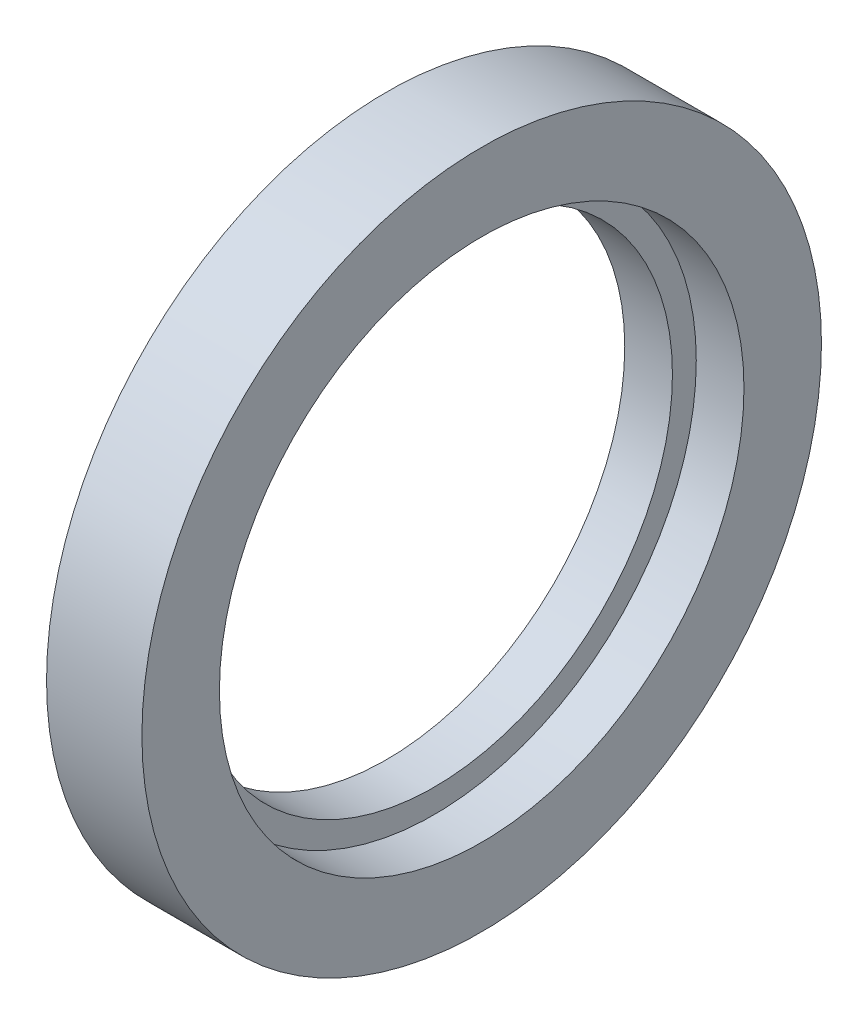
ISO-10303-21;
HEADER;
FILE_DESCRIPTION(('STEP AP214'),'2;1');
FILE_NAME('part.step','',(''),(''),'','','');
FILE_SCHEMA(('AUTOMOTIVE_DESIGN { 1 0 10303 214 1 1 1 1 }'));
ENDSEC;
DATA;
#1=APPLICATION_CONTEXT('core data for automotive mechanical design processes');
#2=APPLICATION_PROTOCOL_DEFINITION('international standard','automotive_design',2000,#1);
#3=PRODUCT_CONTEXT('',#1,'mechanical');
#4=PRODUCT('Part','Part','',(#3));
#5=PRODUCT_RELATED_PRODUCT_CATEGORY('part','',(#4));
#6=PRODUCT_DEFINITION_FORMATION('','',#4);
#7=PRODUCT_DEFINITION_CONTEXT('part definition',#1,'design');
#8=PRODUCT_DEFINITION('design','',#6,#7);
#9=PRODUCT_DEFINITION_SHAPE('','',#8);
#10=(LENGTH_UNIT() NAMED_UNIT(*) SI_UNIT(.MILLI.,.METRE.));
#11=(NAMED_UNIT(*) PLANE_ANGLE_UNIT() SI_UNIT($,.RADIAN.));
#12=(NAMED_UNIT(*) SI_UNIT($,.STERADIAN.) SOLID_ANGLE_UNIT());
#13=UNCERTAINTY_MEASURE_WITH_UNIT(LENGTH_MEASURE(1.E-05),#10,'distance_accuracy_value','');
#14=(GEOMETRIC_REPRESENTATION_CONTEXT(3) GLOBAL_UNCERTAINTY_ASSIGNED_CONTEXT((#13)) GLOBAL_UNIT_ASSIGNED_CONTEXT((#10,
#11,#12)) REPRESENTATION_CONTEXT('',''));
#15=CARTESIAN_POINT('',(0.,0.,0.));
#16=DIRECTION('',(0.,0.,1.));
#17=DIRECTION('',(1.,0.,0.));
#18=AXIS2_PLACEMENT_3D('',#15,#16,#17);
#19=CARTESIAN_POINT('',(20.,0.,0.));
#20=DIRECTION('',(-1.,0.,0.));
#21=DIRECTION('',(0.,0.,1.));
#22=AXIS2_PLACEMENT_3D('',#19,#20,#21);
#23=CYLINDRICAL_SURFACE('',#22,50.);
#24=CARTESIAN_POINT('',(0.,0.,0.));
#25=DIRECTION('',(1.,0.,0.));
#26=DIRECTION('',(0.,0.,-1.));
#27=AXIS2_PLACEMENT_3D('',#24,#25,#26);
#28=CIRCLE('',#27,50.);
#29=CARTESIAN_POINT('',(0.,0.,-50.));
#30=VERTEX_POINT('',#29);
#31=EDGE_CURVE('E44',#30,#30,#28,.T.);
#32=ORIENTED_EDGE('',*,*,#31,.F.);
#33=EDGE_LOOP('',(#32));
#34=FACE_BOUND('',#33,.T.);
#35=CARTESIAN_POINT('',(10.,0.,0.));
#36=DIRECTION('',(1.,0.,0.));
#37=DIRECTION('',(0.,0.,-1.));
#38=AXIS2_PLACEMENT_3D('',#35,#36,#37);
#39=CIRCLE('',#38,50.);
#40=CARTESIAN_POINT('',(10.,0.,-50.));
#41=VERTEX_POINT('',#40);
#42=EDGE_CURVE('E35',#41,#41,#39,.T.);
#43=ORIENTED_EDGE('',*,*,#42,.T.);
#44=EDGE_LOOP('',(#43));
#45=FACE_BOUND('',#44,.T.);
#46=ADVANCED_FACE('F31',(#34,#45),#23,.F.);
#47=CARTESIAN_POINT('',(20.,0.,0.));
#48=DIRECTION('',(1.,0.,0.));
#49=DIRECTION('',(0.,0.,-1.));
#50=AXIS2_PLACEMENT_3D('',#47,#48,#49);
#51=PLANE('',#50);
#52=CARTESIAN_POINT('',(20.,0.,0.));
#53=DIRECTION('',(1.,0.,0.));
#54=DIRECTION('',(0.,0.,-1.));
#55=AXIS2_PLACEMENT_3D('',#52,#53,#54);
#56=CIRCLE('',#55,55.);
#57=CARTESIAN_POINT('',(20.,0.,-55.));
#58=VERTEX_POINT('',#57);
#59=EDGE_CURVE('E48',#58,#58,#56,.T.);
#60=ORIENTED_EDGE('',*,*,#59,.F.);
#61=EDGE_LOOP('',(#60));
#62=FACE_BOUND('',#61,.T.);
#63=CARTESIAN_POINT('',(20.,0.,0.));
#64=DIRECTION('',(1.,0.,0.));
#65=DIRECTION('',(0.,0.,-1.));
#66=AXIS2_PLACEMENT_3D('',#63,#64,#65);
#67=CIRCLE('',#66,71.25);
#68=CARTESIAN_POINT('',(20.,0.,-71.25));
#69=VERTEX_POINT('',#68);
#70=EDGE_CURVE('E10',#69,#69,#67,.T.);
#71=ORIENTED_EDGE('',*,*,#70,.T.);
#72=EDGE_LOOP('',(#71));
#73=FACE_BOUND('',#72,.T.);
#74=ADVANCED_FACE('F69',(#62,#73),#51,.T.);
#75=CARTESIAN_POINT('',(0.,0.,0.));
#76=DIRECTION('',(1.,0.,0.));
#77=DIRECTION('',(0.,0.,-1.));
#78=AXIS2_PLACEMENT_3D('',#75,#76,#77);
#79=PLANE('',#78);
#80=CARTESIAN_POINT('',(0.,0.,0.));
#81=DIRECTION('',(1.,0.,0.));
#82=DIRECTION('',(0.,0.,-1.));
#83=AXIS2_PLACEMENT_3D('',#80,#81,#82);
#84=CIRCLE('',#83,71.25);
#85=CARTESIAN_POINT('',(0.,0.,-71.25));
#86=VERTEX_POINT('',#85);
#87=EDGE_CURVE('E39',#86,#86,#84,.T.);
#88=ORIENTED_EDGE('',*,*,#87,.F.);
#89=EDGE_LOOP('',(#88));
#90=FACE_BOUND('',#89,.T.);
#91=ORIENTED_EDGE('',*,*,#31,.T.);
#92=EDGE_LOOP('',(#91));
#93=FACE_BOUND('',#92,.T.);
#94=ADVANCED_FACE('F75',(#90,#93),#79,.F.);
#95=CARTESIAN_POINT('',(20.,0.,0.));
#96=DIRECTION('',(-1.,0.,0.));
#97=DIRECTION('',(0.,0.,1.));
#98=AXIS2_PLACEMENT_3D('',#95,#96,#97);
#99=CYLINDRICAL_SURFACE('',#98,71.25);
#100=ORIENTED_EDGE('',*,*,#70,.F.);
#101=EDGE_LOOP('',(#100));
#102=FACE_BOUND('',#101,.T.);
#103=ORIENTED_EDGE('',*,*,#87,.T.);
#104=EDGE_LOOP('',(#103));
#105=FACE_BOUND('',#104,.T.);
#106=ADVANCED_FACE('F33',(#102,#105),#99,.T.);
#107=CARTESIAN_POINT('',(10.,0.,0.));
#108=DIRECTION('',(1.,0.,0.));
#109=DIRECTION('',(0.,0.,-1.));
#110=AXIS2_PLACEMENT_3D('',#107,#108,#109);
#111=CYLINDRICAL_SURFACE('',#110,55.);
#112=CARTESIAN_POINT('',(10.,0.,0.));
#113=DIRECTION('',(1.,0.,0.));
#114=DIRECTION('',(0.,0.,-1.));
#115=AXIS2_PLACEMENT_3D('',#112,#113,#114);
#116=CIRCLE('',#115,55.);
#117=CARTESIAN_POINT('',(10.,0.,-55.));
#118=VERTEX_POINT('',#117);
#119=EDGE_CURVE('E51',#118,#118,#116,.T.);
#120=ORIENTED_EDGE('',*,*,#119,.F.);
#121=EDGE_LOOP('',(#120));
#122=FACE_BOUND('',#121,.T.);
#123=ORIENTED_EDGE('',*,*,#59,.T.);
#124=EDGE_LOOP('',(#123));
#125=FACE_BOUND('',#124,.T.);
#126=ADVANCED_FACE('F61',(#122,#125),#111,.F.);
#127=CARTESIAN_POINT('',(10.,0.,0.));
#128=DIRECTION('',(1.,0.,0.));
#129=DIRECTION('',(0.,0.,-1.));
#130=AXIS2_PLACEMENT_3D('',#127,#128,#129);
#131=PLANE('',#130);
#132=ORIENTED_EDGE('',*,*,#42,.F.);
#133=EDGE_LOOP('',(#132));
#134=FACE_BOUND('',#133,.T.);
#135=ORIENTED_EDGE('',*,*,#119,.T.);
#136=EDGE_LOOP('',(#135));
#137=FACE_BOUND('',#136,.T.);
#138=ADVANCED_FACE('F59',(#134,#137),#131,.T.);
#139=CLOSED_SHELL('',(#46,#74,#94,#106,#126,#138));
#140=MANIFOLD_SOLID_BREP('B2',#139);
#141=ADVANCED_BREP_SHAPE_REPRESENTATION('',(#18,#140),#14);
#142=SHAPE_DEFINITION_REPRESENTATION(#9,#141);
ENDSEC;
END-ISO-10303-21;
